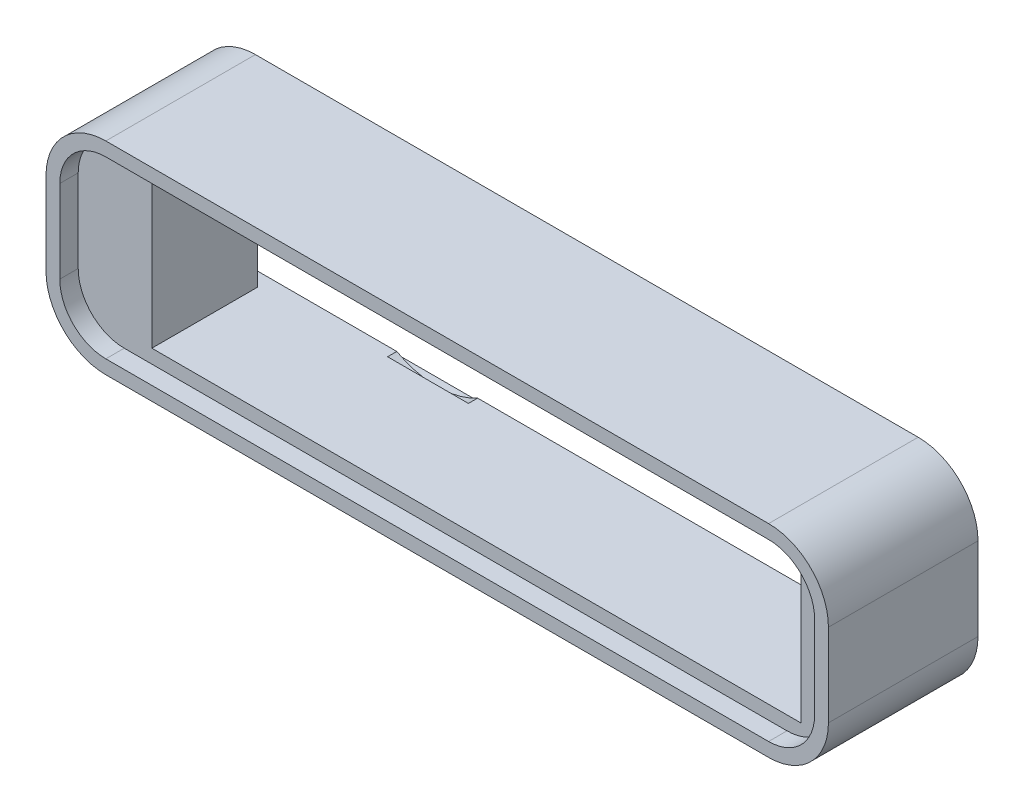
from build123d import *

# Parameters (mm, degrees)
EXTRUDE_1_DEPTH     = 5
EXTRUDE_2_DEPTH     = 4
EXTRUDE_START       = 21
EXTRUDE_3_DEPTH     = 21
CUT_EXTRUDE_1_DEPTH = 92.569645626
SKETCH_5_W          = 8
SKETCH_5_H          = 33
CUT_EXTRUDE_2_DEPTH = 24
EXTRUDE_START_2     = -28.5
EXTRUDE_4_DEPTH     = 2.5
CUT_EXTRUDE_3_REACH = 156.393
SKETCH_6_W          = 3
SKETCH_6_H          = 10
CUT_EXTRUDE_4_REACH = 98.226
SKETCH_7_W          = 5
SKETCH_7_H          = 20
SKETCH_8_R          = 18.25
CUT_EXTRUDE_5_DEPTH = 2
SKETCH_11_R         = 4.75
CUT_EXTRUDE_6_DEPTH = 1


with BuildPart() as part:
    # Sketch 1 → Extrude 1 (new body)
    with BuildSketch(Plane.XY):
        with BuildLine():
            Line((-72, 22), (72, 22))
            ThreePointArc((72, 22), (81.192388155, 18.192388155), (85, 9))
            Line((85, 9), (85, -9))
            ThreePointArc((85, -9), (81.192388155, -18.192388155), (72, -22))
            Line((72, -22), (-72, -22))
            ThreePointArc((-72, -22), (-81.192388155, -18.192388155), (-85, -9))
            Line((-85, -9), (-85, 9))
            ThreePointArc((-85, 9), (-81.192388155, 18.192388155), (-72, 22))
        make_face()
    extrude(amount=EXTRUDE_1_DEPTH)

    # Sketch 2 → Extrude 2 (add)
    with BuildSketch(Plane.XY.offset(5)):
        with BuildLine():
            Line((-72, -22), (72, -22))
            ThreePointArc((72, -22), (81.192388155, -18.192388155), (85, -9))
            Line((85, -9), (85, 9))
            ThreePointArc((85, 9), (81.192388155, 18.192388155), (72, 22))
            Line((72, 22), (-72, 22))
            ThreePointArc((-72, 22), (-81.192388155, 18.192388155), (-85, 9))
            Line((-85, 9), (-85, -9))
            ThreePointArc((-85, -9), (-81.192388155, -18.192388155), (-72, -22))
        make_face()
        with BuildLine():
            Line((-72, -19), (72, -19))
            ThreePointArc((72, -19), (79.071067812, -16.071067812), (82, -9))
            Line((82, -9), (82, 9))
            ThreePointArc((82, 9), (79.071067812, 16.071067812), (72, 19))
            Line((72, 19), (-72, 19))
            ThreePointArc((-72, 19), (-79.071067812, 16.071067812), (-82, 9))
            Line((-82, 9), (-82, -9))
            ThreePointArc((-82, -9), (-79.071067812, -16.071067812), (-72, -19))
        make_face(mode=Mode.SUBTRACT)
    extrude(amount=EXTRUDE_2_DEPTH)

    # Sketch 4 → Extrude 3 (add)
    with BuildSketch(Plane(origin=(0, 0, 0), x_dir=(-1, 0, 0), z_dir=(0, 0, -1)).offset(EXTRUDE_START)):
        with BuildLine():
            Line((72, 22), (-72, 22))
            ThreePointArc((-72, 22), (-81.192388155, 18.192388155), (-85, 9))
            Line((-85, 9), (-85, -9))
            ThreePointArc((-85, -9), (-81.192388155, -18.192388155), (-72, -22))
            Line((-72, -22), (72, -22))
            ThreePointArc((72, -22), (81.192388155, -18.192388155), (85, -9))
            Line((85, -9), (85, 9))
            ThreePointArc((85, 9), (81.192388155, 18.192388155), (72, 22))
        make_face()
    extrude(amount=-EXTRUDE_3_DEPTH)

    # Sketch 3 → Cut-Extrude 1 (cut, through all)
    with BuildSketch(Plane.XY.offset(5)):
        Polygon((-66, 16), (66, 16), (75, 16), (75, -16), (66, -16), (-66, -16), align=None)
    extrude(amount=-CUT_EXTRUDE_1_DEPTH, mode=Mode.SUBTRACT)

    # Sketch 5 → Cut-Extrude 2 (cut)
    with BuildSketch(Plane(origin=(0, 0, -21), x_dir=(-1, 0, 0), z_dir=(0, 0, -1))):
        with Locations((73, 0)):
            Rectangle(SKETCH_5_W, SKETCH_5_H)
    extrude(amount=-CUT_EXTRUDE_2_DEPTH, mode=Mode.SUBTRACT)

    # Sketch 2_2 → Extrude 4 (add)
    with BuildSketch(Plane.XY.offset(5).offset(EXTRUDE_START_2)):
        with BuildLine():
            Line((-72, -22), (72, -22))
            ThreePointArc((72, -22), (81.192388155, -18.192388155), (85, -9))
            Line((85, -9), (85, 9))
            ThreePointArc((85, 9), (81.192388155, 18.192388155), (72, 22))
            Line((72, 22), (-72, 22))
            ThreePointArc((-72, 22), (-81.192388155, 18.192388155), (-85, 9))
            Line((-85, 9), (-85, -9))
            ThreePointArc((-85, -9), (-81.192388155, -18.192388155), (-72, -22))
        make_face()
        with BuildLine():
            Line((-72, -19), (72, -19))
            ThreePointArc((72, -19), (79.071067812, -16.071067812), (82, -9))
            Line((82, -9), (82, 9))
            ThreePointArc((82, 9), (79.071067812, 16.071067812), (72, 19))
            Line((72, 19), (-72, 19))
            ThreePointArc((-72, 19), (-79.071067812, 16.071067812), (-82, 9))
            Line((-82, 9), (-82, -9))
            ThreePointArc((-82, -9), (-79.071067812, -16.071067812), (-72, -19))
        make_face(mode=Mode.SUBTRACT)
    extrude(amount=EXTRUDE_4_DEPTH)

    # Sketch 6 → Cut-Extrude 3 (cut, up to next)
    with BuildSketch(Plane(origin=(-66, 0, 0), x_dir=(0, 0, -1), z_dir=(1, 0, 0)), mode=Mode.PRIVATE) as cut_extrude_3_sk1:
        with Locations((19.5, -11)):
            Rectangle(SKETCH_6_W, SKETCH_6_H)
    cut_extrude_3_tool1 = extrude(cut_extrude_3_sk1.sketch, amount=-CUT_EXTRUDE_3_REACH, mode=Mode.PRIVATE) & part.part
    add(cut_extrude_3_tool1.solids().sort_by_distance((-66, -11, -19.5))[0], mode=Mode.SUBTRACT)

    # Sketch 7 → Cut-Extrude 4 (cut, up to next)
    with BuildSketch(Plane(origin=(0, -16.5, 0), x_dir=(1, 0, 0), z_dir=(0, 1, 0)), mode=Mode.PRIVATE) as cut_extrude_4_sk1:
        with Locations((-73, 9)):
            Rectangle(SKETCH_7_W, SKETCH_7_H)
    cut_extrude_4_tool1 = extrude(cut_extrude_4_sk1.sketch, amount=-CUT_EXTRUDE_4_REACH, mode=Mode.PRIVATE) & part.part
    add(cut_extrude_4_tool1.solids().sort_by_distance((-73, -16.5, -9))[0], mode=Mode.SUBTRACT)

    # Sketch 8 → Cut-Extrude 5 (cut)
    with BuildSketch(Plane(origin=(0, 0, -21), x_dir=(-1, 0, 0), z_dir=(0, 0, -1))):
        with Locations((30, 0)):
            Circle(SKETCH_8_R)
    extrude(amount=-CUT_EXTRUDE_5_DEPTH, mode=Mode.SUBTRACT)

    # Sketch 11 → Cut-Extrude 6 (cut)
    with BuildSketch(Plane.XZ.offset(22)):
        with Locations(Location((-60, 0, 0), (0, 0, 270))):
            Circle(SKETCH_11_R)
        with Locations(Location((60, 0, 0), (0, 0, 270))):
            Circle(SKETCH_11_R)
        with Locations(Location((0, -14.5, 0), (0, 0, 270))):
            Circle(SKETCH_11_R)
    extrude(amount=-CUT_EXTRUDE_6_DEPTH, mode=Mode.SUBTRACT)


solid = part.part
